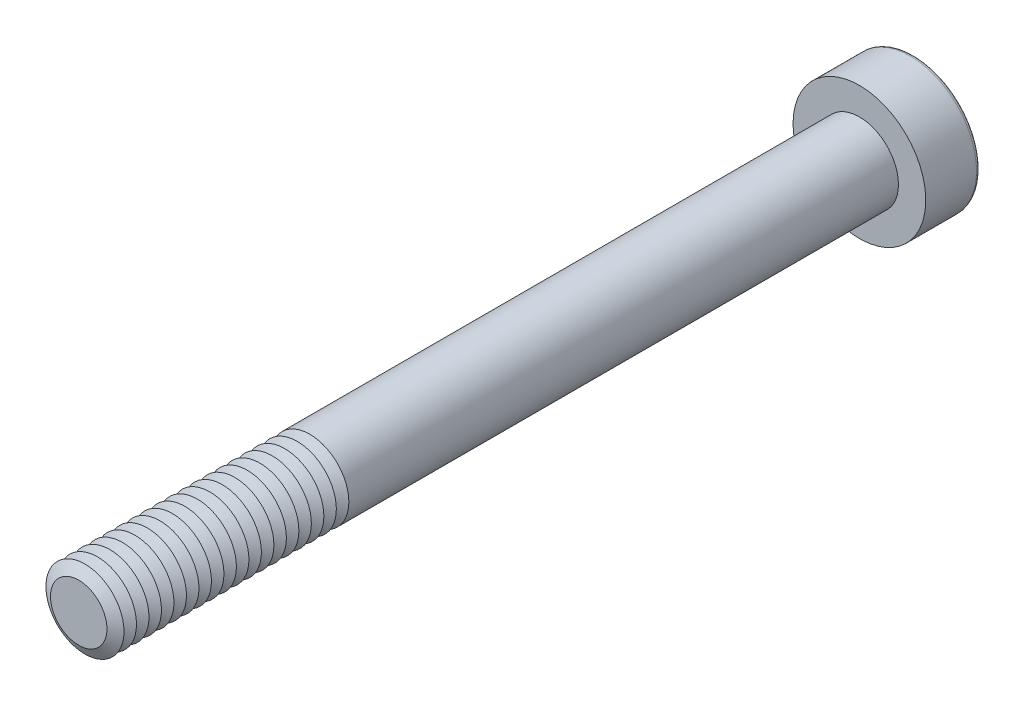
from build123d import *

# Parameters (mm, degrees)
SKETCH1_R           = 2.5
BOSS_EXTRUDE1_DEPTH = 50
SKETCH2_R           = 4.25
BOSS_EXTRUDE2_DEPTH = 3.5
CUT_EXTRUDE1_DEPTH  = 2.25
FILLET1_R           = 0.25
LPATTERN1_COUNT     = 19
LPATTERN1_PITCH     = 0.8


with BuildPart() as part:
    # Sketch1 → Boss-Extrude1 (new body)
    with BuildSketch(Plane.XY):
        Circle(SKETCH1_R)
    extrude(amount=BOSS_EXTRUDE1_DEPTH)

    # Sketch2 → Boss-Extrude2 (add)
    with BuildSketch(Plane(origin=(0, 0, 0), x_dir=(-1, 0, 0), z_dir=(0, 0, -1))):
        Circle(SKETCH2_R)
    extrude(amount=BOSS_EXTRUDE2_DEPTH)

    # Sketch3 → Cut-Extrude1 (cut)
    with BuildSketch(Plane(origin=(0, 0, -3.5), x_dir=(-1, 0, 0), z_dir=(0, 0, -1))):
        Polygon((-0.866025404, 1.5), (-1.732050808, 0), (-0.866025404, -1.5), (0.866025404, -1.5), (1.732050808, 0), (0.866025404, 1.5), align=None)
    extrude(amount=-CUT_EXTRUDE1_DEPTH, mode=Mode.SUBTRACT)

    # Fillet1
    fillet1_edges = [part.edges().sort_by_distance(p)[0] for p in [
        (4.25, 0, -3.5),
    ]]
    fillet(fillet1_edges, radius=FILLET1_R)

    # Cut-Extrude2 cone 1 section (on through the dimple's axis) → Cut-Extrude2 (revolve, cut)
    with BuildSketch(Plane(origin=(0, 0, -1.25), x_dir=(0, 1, 0), z_dir=(1, 0, 0))):
        Polygon((0, 0), (1.5, 0), (0, 0.866025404), align=None)
    revolve(axis=Axis((0, 0, -1.25), (0, 0, 1)), mode=Mode.SUBTRACT)

    # Cut-Extrude3 cone 1 section (on through the dimple's axis) → Cut-Extrude3 (revolve, cut)
    with BuildSketch(Plane(origin=(0, 0, -3.5), x_dir=(0, 1, 0), z_dir=(1, 0, 0))):
        Polygon((0, 0), (1.732050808, 0), (0, 0.464101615), align=None)
    revolve(axis=Axis((0, 0, -3.5), (0, 0, 1)), mode=Mode.SUBTRACT)

    # Sketch7 → Cut-Revolve1 (revolve, cut)
    with BuildSketch(Plane(origin=(0, 0, 0), x_dir=(0, 0, -1), z_dir=(1, 0, 0)), mode=Mode.PRIVATE) as cut_revolve1_sk:
        Polygon((-50, 1.807179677), (-49.6, 2.5), (-50.4, 2.5), align=None)
    cut_revolve1 = revolve(cut_revolve1_sk.sketch.rotate(Axis((0, 0, 50), (0, 0, -1)), 90), axis=Axis((0, 0, 50), (0, 0, -1)), mode=Mode.SUBTRACT)

    # LPattern1: Cut-Revolve1 ×19
    with Locations(*[(0, 0, -i * LPATTERN1_PITCH) for i in range(1, LPATTERN1_COUNT)]):
        add(cut_revolve1, mode=Mode.SUBTRACT)


solid = part.part
